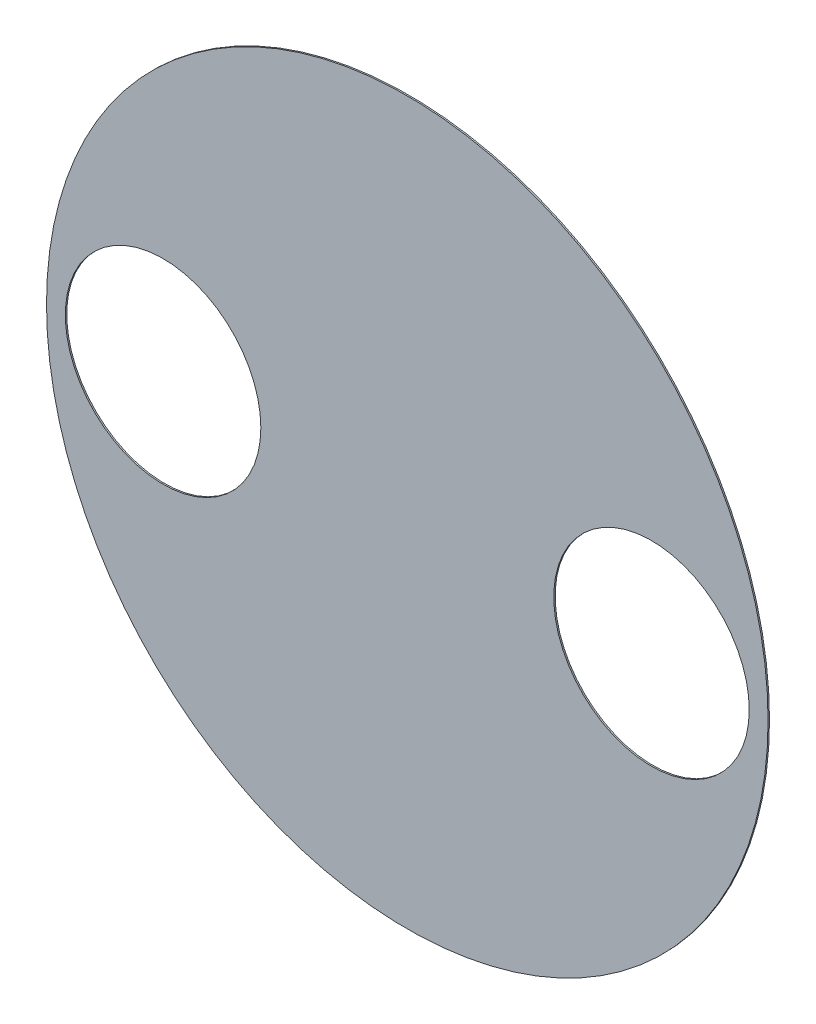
ISO-10303-21;
HEADER;
FILE_DESCRIPTION(('STEP AP214'),'2;1');
FILE_NAME('part.step','',(''),(''),'','','');
FILE_SCHEMA(('AUTOMOTIVE_DESIGN { 1 0 10303 214 1 1 1 1 }'));
ENDSEC;
DATA;
#1=APPLICATION_CONTEXT('core data for automotive mechanical design processes');
#2=APPLICATION_PROTOCOL_DEFINITION('international standard','automotive_design',2000,#1);
#3=PRODUCT_CONTEXT('',#1,'mechanical');
#4=PRODUCT('Part','Part','',(#3));
#5=PRODUCT_RELATED_PRODUCT_CATEGORY('part','',(#4));
#6=PRODUCT_DEFINITION_FORMATION('','',#4);
#7=PRODUCT_DEFINITION_CONTEXT('part definition',#1,'design');
#8=PRODUCT_DEFINITION('design','',#6,#7);
#9=PRODUCT_DEFINITION_SHAPE('','',#8);
#10=(LENGTH_UNIT() NAMED_UNIT(*) SI_UNIT(.MILLI.,.METRE.));
#11=(NAMED_UNIT(*) PLANE_ANGLE_UNIT() SI_UNIT($,.RADIAN.));
#12=(NAMED_UNIT(*) SI_UNIT($,.STERADIAN.) SOLID_ANGLE_UNIT());
#13=UNCERTAINTY_MEASURE_WITH_UNIT(LENGTH_MEASURE(1.E-05),#10,'distance_accuracy_value','');
#14=(GEOMETRIC_REPRESENTATION_CONTEXT(3) GLOBAL_UNCERTAINTY_ASSIGNED_CONTEXT((#13)) GLOBAL_UNIT_ASSIGNED_CONTEXT((#10,
#11,#12)) REPRESENTATION_CONTEXT('',''));
#15=CARTESIAN_POINT('',(0.,0.,0.));
#16=DIRECTION('',(0.,0.,1.));
#17=DIRECTION('',(1.,0.,0.));
#18=AXIS2_PLACEMENT_3D('',#15,#16,#17);
#19=CARTESIAN_POINT('',(0.,0.,-2.));
#20=DIRECTION('',(0.,0.,1.));
#21=DIRECTION('',(1.,0.,0.));
#22=AXIS2_PLACEMENT_3D('',#19,#20,#21);
#23=CYLINDRICAL_SURFACE('',#22,507.5);
#24=CARTESIAN_POINT('',(0.,0.,-2.));
#25=DIRECTION('',(0.,0.,1.));
#26=DIRECTION('',(1.,0.,0.));
#27=AXIS2_PLACEMENT_3D('',#24,#25,#26);
#28=CIRCLE('',#27,507.5);
#29=CARTESIAN_POINT('',(507.5,0.,-2.));
#30=VERTEX_POINT('',#29);
#31=EDGE_CURVE('E10',#30,#30,#28,.T.);
#32=ORIENTED_EDGE('',*,*,#31,.T.);
#33=EDGE_LOOP('',(#32));
#34=FACE_BOUND('',#33,.T.);
#35=CARTESIAN_POINT('',(0.,0.,0.));
#36=DIRECTION('',(0.,0.,1.));
#37=DIRECTION('',(1.,0.,0.));
#38=AXIS2_PLACEMENT_3D('',#35,#36,#37);
#39=CIRCLE('',#38,507.5);
#40=CARTESIAN_POINT('',(507.5,0.,0.));
#41=VERTEX_POINT('',#40);
#42=EDGE_CURVE('E39',#41,#41,#39,.T.);
#43=ORIENTED_EDGE('',*,*,#42,.F.);
#44=EDGE_LOOP('',(#43));
#45=FACE_BOUND('',#44,.T.);
#46=ADVANCED_FACE('F36',(#34,#45),#23,.T.);
#47=CARTESIAN_POINT('',(0.,0.,-2.));
#48=DIRECTION('',(0.,0.,1.));
#49=DIRECTION('',(1.,0.,0.));
#50=AXIS2_PLACEMENT_3D('',#47,#48,#49);
#51=PLANE('',#50);
#52=CARTESIAN_POINT('',(343.5,0.,-2.));
#53=DIRECTION('',(0.,0.,1.));
#54=DIRECTION('',(1.,0.,0.));
#55=AXIS2_PLACEMENT_3D('',#52,#53,#54);
#56=CIRCLE('',#55,137.5);
#57=CARTESIAN_POINT('',(481.,0.,-2.));
#58=VERTEX_POINT('',#57);
#59=EDGE_CURVE('E53',#58,#58,#56,.T.);
#60=ORIENTED_EDGE('',*,*,#59,.T.);
#61=EDGE_LOOP('',(#60));
#62=FACE_BOUND('',#61,.T.);
#63=CARTESIAN_POINT('',(-343.5,0.,-2.));
#64=DIRECTION('',(0.,0.,1.));
#65=DIRECTION('',(1.,0.,0.));
#66=AXIS2_PLACEMENT_3D('',#63,#64,#65);
#67=CIRCLE('',#66,137.5);
#68=CARTESIAN_POINT('',(-206.,0.,-2.));
#69=VERTEX_POINT('',#68);
#70=EDGE_CURVE('E46',#69,#69,#67,.T.);
#71=ORIENTED_EDGE('',*,*,#70,.T.);
#72=EDGE_LOOP('',(#71));
#73=FACE_BOUND('',#72,.T.);
#74=ORIENTED_EDGE('',*,*,#31,.F.);
#75=EDGE_LOOP('',(#74));
#76=FACE_BOUND('',#75,.T.);
#77=ADVANCED_FACE('F67',(#62,#73,#76),#51,.F.);
#78=CARTESIAN_POINT('',(0.,0.,0.));
#79=DIRECTION('',(0.,0.,1.));
#80=DIRECTION('',(1.,0.,0.));
#81=AXIS2_PLACEMENT_3D('',#78,#79,#80);
#82=PLANE('',#81);
#83=CARTESIAN_POINT('',(343.5,0.,0.));
#84=DIRECTION('',(0.,0.,1.));
#85=DIRECTION('',(1.,0.,0.));
#86=AXIS2_PLACEMENT_3D('',#83,#84,#85);
#87=CIRCLE('',#86,137.5);
#88=CARTESIAN_POINT('',(481.,0.,0.));
#89=VERTEX_POINT('',#88);
#90=EDGE_CURVE('E56',#89,#89,#87,.T.);
#91=ORIENTED_EDGE('',*,*,#90,.F.);
#92=EDGE_LOOP('',(#91));
#93=FACE_BOUND('',#92,.T.);
#94=CARTESIAN_POINT('',(-343.5,0.,0.));
#95=DIRECTION('',(0.,0.,1.));
#96=DIRECTION('',(1.,0.,0.));
#97=AXIS2_PLACEMENT_3D('',#94,#95,#96);
#98=CIRCLE('',#97,137.5);
#99=CARTESIAN_POINT('',(-206.,0.,0.));
#100=VERTEX_POINT('',#99);
#101=EDGE_CURVE('E50',#100,#100,#98,.T.);
#102=ORIENTED_EDGE('',*,*,#101,.F.);
#103=EDGE_LOOP('',(#102));
#104=FACE_BOUND('',#103,.T.);
#105=ORIENTED_EDGE('',*,*,#42,.T.);
#106=EDGE_LOOP('',(#105));
#107=FACE_BOUND('',#106,.T.);
#108=ADVANCED_FACE('F63',(#93,#104,#107),#82,.T.);
#109=CARTESIAN_POINT('',(-343.5,0.,-10.));
#110=DIRECTION('',(0.,0.,1.));
#111=DIRECTION('',(1.,0.,0.));
#112=AXIS2_PLACEMENT_3D('',#109,#110,#111);
#113=CYLINDRICAL_SURFACE('',#112,137.5);
#114=ORIENTED_EDGE('',*,*,#101,.T.);
#115=EDGE_LOOP('',(#114));
#116=FACE_BOUND('',#115,.T.);
#117=ORIENTED_EDGE('',*,*,#70,.F.);
#118=EDGE_LOOP('',(#117));
#119=FACE_BOUND('',#118,.T.);
#120=ADVANCED_FACE('F66',(#116,#119),#113,.F.);
#121=CARTESIAN_POINT('',(343.5,0.,-10.));
#122=DIRECTION('',(0.,0.,1.));
#123=DIRECTION('',(1.,0.,0.));
#124=AXIS2_PLACEMENT_3D('',#121,#122,#123);
#125=CYLINDRICAL_SURFACE('',#124,137.5);
#126=ORIENTED_EDGE('',*,*,#90,.T.);
#127=EDGE_LOOP('',(#126));
#128=FACE_BOUND('',#127,.T.);
#129=ORIENTED_EDGE('',*,*,#59,.F.);
#130=EDGE_LOOP('',(#129));
#131=FACE_BOUND('',#130,.T.);
#132=ADVANCED_FACE('F60',(#128,#131),#125,.F.);
#133=CLOSED_SHELL('',(#46,#77,#108,#120,#132));
#134=MANIFOLD_SOLID_BREP('B2',#133);
#135=ADVANCED_BREP_SHAPE_REPRESENTATION('',(#18,#134),#14);
#136=SHAPE_DEFINITION_REPRESENTATION(#9,#135);
ENDSEC;
END-ISO-10303-21;
